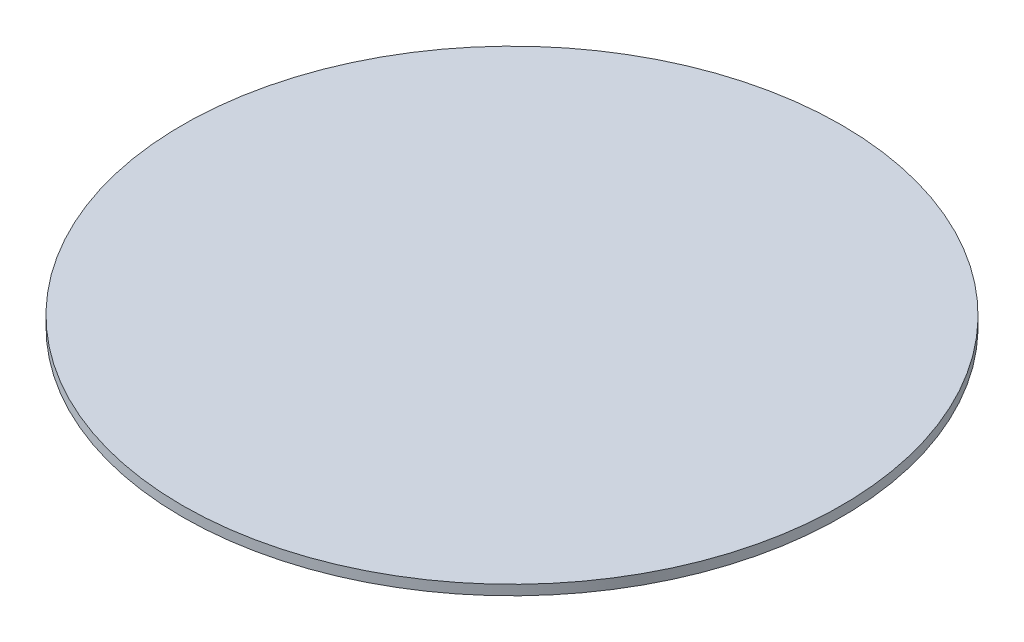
from build123d import *

# Parameters (mm, degrees)
SKETCH1_R      = 838.2
EXTRUDE1_DEPTH = 25.4


with BuildPart() as part:
    # Sketch1 → Extrude1 (new body)
    with BuildSketch(Plane(origin=(0, 0, 0), x_dir=(1, 0, 0), z_dir=(0, 1, 0))):
        with Locations(Location((0, 0, 0), (0, 0, 270))):
            Circle(SKETCH1_R)
    extrude(amount=EXTRUDE1_DEPTH)


solid = part.part
